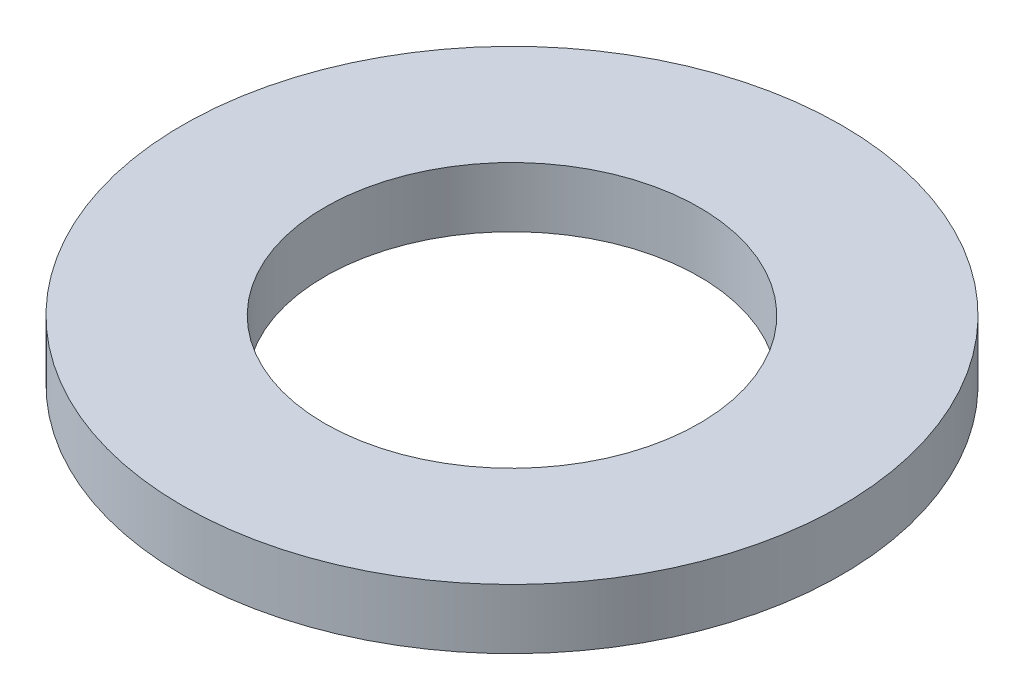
from build123d import *

# Parameters (mm, degrees)
SKETCH1_R      = 22
SKETCH1_R_2    = 12.5
EXTRUDE1_DEPTH = 4


with BuildPart() as part:
    # Sketch1 → Extrude1 (new body)
    with BuildSketch(Plane(origin=(0, 0, 0), x_dir=(1, 0, 0), z_dir=(0, 1, 0))):
        with Locations(Location((0, 0, 0), (0, 0, 270))):
            Circle(SKETCH1_R)
        with Locations(Location((0, 0, 0), (0, 0, 270))):
            Circle(SKETCH1_R_2, mode=Mode.SUBTRACT)
    extrude(amount=EXTRUDE1_DEPTH)


solid = part.part
